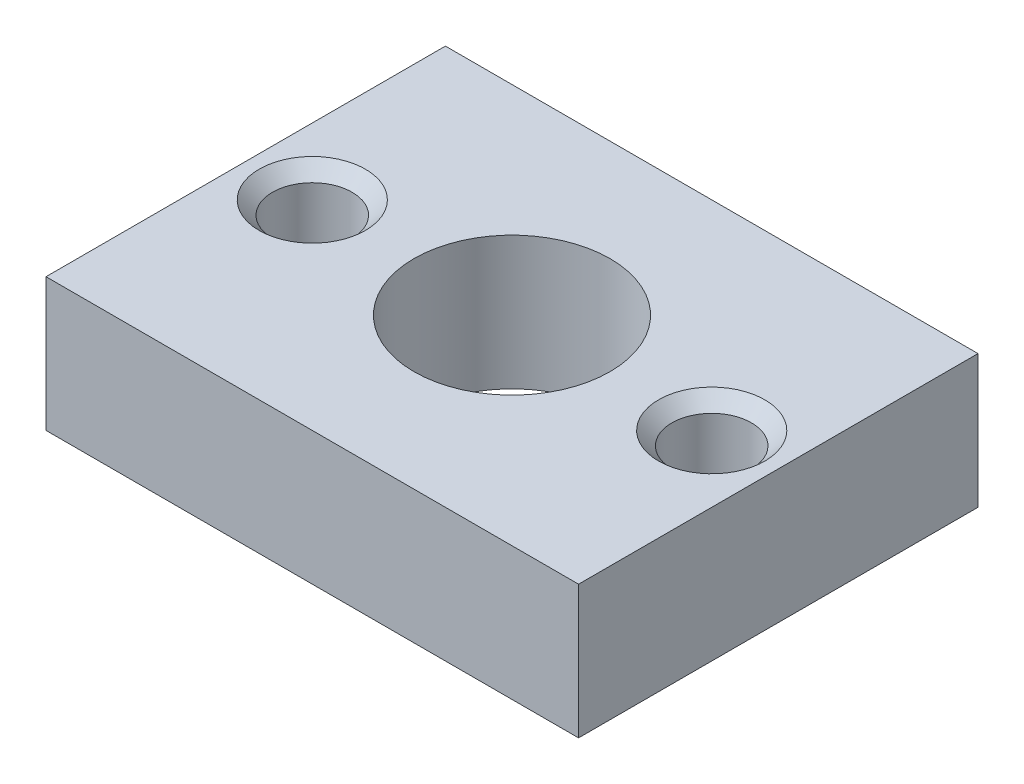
ISO-10303-21;
HEADER;
FILE_DESCRIPTION(('STEP AP214'),'2;1');
FILE_NAME('part.step','',(''),(''),'','','');
FILE_SCHEMA(('AUTOMOTIVE_DESIGN { 1 0 10303 214 1 1 1 1 }'));
ENDSEC;
DATA;
#1=APPLICATION_CONTEXT('core data for automotive mechanical design processes');
#2=APPLICATION_PROTOCOL_DEFINITION('international standard','automotive_design',2000,#1);
#3=PRODUCT_CONTEXT('',#1,'mechanical');
#4=PRODUCT('Part','Part','',(#3));
#5=PRODUCT_RELATED_PRODUCT_CATEGORY('part','',(#4));
#6=PRODUCT_DEFINITION_FORMATION('','',#4);
#7=PRODUCT_DEFINITION_CONTEXT('part definition',#1,'design');
#8=PRODUCT_DEFINITION('design','',#6,#7);
#9=PRODUCT_DEFINITION_SHAPE('','',#8);
#10=(LENGTH_UNIT() NAMED_UNIT(*) SI_UNIT(.MILLI.,.METRE.));
#11=(NAMED_UNIT(*) PLANE_ANGLE_UNIT() SI_UNIT($,.RADIAN.));
#12=(NAMED_UNIT(*) SI_UNIT($,.STERADIAN.) SOLID_ANGLE_UNIT());
#13=UNCERTAINTY_MEASURE_WITH_UNIT(LENGTH_MEASURE(1.E-05),#10,'distance_accuracy_value','');
#14=(GEOMETRIC_REPRESENTATION_CONTEXT(3) GLOBAL_UNCERTAINTY_ASSIGNED_CONTEXT((#13)) GLOBAL_UNIT_ASSIGNED_CONTEXT((#10,
#11,#12)) REPRESENTATION_CONTEXT('',''));
#15=CARTESIAN_POINT('',(0.,0.,0.));
#16=DIRECTION('',(0.,0.,1.));
#17=DIRECTION('',(1.,0.,0.));
#18=AXIS2_PLACEMENT_3D('',#15,#16,#17);
#19=CARTESIAN_POINT('',(12.7,0.,-9.525));
#20=DIRECTION('',(0.,-1.,0.));
#21=DIRECTION('',(0.,0.,-1.));
#22=AXIS2_PLACEMENT_3D('',#19,#20,#21);
#23=PLANE('',#22);
#24=CARTESIAN_POINT('',(0.,0.,0.));
#25=DIRECTION('',(0.,1.,0.));
#26=DIRECTION('',(0.,0.,1.));
#27=AXIS2_PLACEMENT_3D('',#24,#25,#26);
#28=CIRCLE('',#27,4.6736);
#29=CARTESIAN_POINT('',(0.,0.,4.6736));
#30=VERTEX_POINT('',#29);
#31=EDGE_CURVE('E127',#30,#30,#28,.T.);
#32=ORIENTED_EDGE('',*,*,#31,.T.);
#33=EDGE_LOOP('',(#32));
#34=FACE_BOUND('',#33,.T.);
#35=DIRECTION('',(0.,0.,-1.));
#36=VECTOR('',#35,1.);
#37=CARTESIAN_POINT('',(12.7,0.,9.525));
#38=LINE('',#37,#36);
#39=CARTESIAN_POINT('',(12.7,0.,9.525));
#40=VERTEX_POINT('',#39);
#41=CARTESIAN_POINT('',(12.7,0.,-9.525));
#42=VERTEX_POINT('',#41);
#43=EDGE_CURVE('E96',#40,#42,#38,.T.);
#44=ORIENTED_EDGE('',*,*,#43,.F.);
#45=DIRECTION('',(1.,0.,0.));
#46=VECTOR('',#45,1.);
#47=CARTESIAN_POINT('',(-12.7,0.,9.525));
#48=LINE('',#47,#46);
#49=CARTESIAN_POINT('',(-12.7,0.,9.525));
#50=VERTEX_POINT('',#49);
#51=EDGE_CURVE('E72',#50,#40,#48,.T.);
#52=ORIENTED_EDGE('',*,*,#51,.F.);
#53=DIRECTION('',(0.,0.,1.));
#54=VECTOR('',#53,1.);
#55=CARTESIAN_POINT('',(-12.7,0.,9.525));
#56=LINE('',#55,#54);
#57=CARTESIAN_POINT('',(-12.7,0.,-9.525));
#58=VERTEX_POINT('',#57);
#59=EDGE_CURVE('E66',#58,#50,#56,.T.);
#60=ORIENTED_EDGE('',*,*,#59,.F.);
#61=DIRECTION('',(-1.,0.,0.));
#62=VECTOR('',#61,1.);
#63=CARTESIAN_POINT('',(-12.7,0.,-9.525));
#64=LINE('',#63,#62);
#65=EDGE_CURVE('E88',#42,#58,#64,.T.);
#66=ORIENTED_EDGE('',*,*,#65,.F.);
#67=EDGE_LOOP('',(#44,#52,#60,#66));
#68=FACE_BOUND('',#67,.T.);
#69=CARTESIAN_POINT('',(9.525,0.,0.));
#70=DIRECTION('',(0.,1.,0.));
#71=DIRECTION('',(0.,0.,1.));
#72=AXIS2_PLACEMENT_3D('',#69,#70,#71);
#73=CIRCLE('',#72,1.89864999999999);
#74=CARTESIAN_POINT('',(9.525,0.,1.89864999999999));
#75=VERTEX_POINT('',#74);
#76=EDGE_CURVE('E99',#75,#75,#73,.T.);
#77=ORIENTED_EDGE('',*,*,#76,.T.);
#78=EDGE_LOOP('',(#77));
#79=FACE_BOUND('',#78,.T.);
#80=CARTESIAN_POINT('',(-9.525,0.,0.));
#81=DIRECTION('',(0.,1.,0.));
#82=DIRECTION('',(0.,0.,1.));
#83=AXIS2_PLACEMENT_3D('',#80,#81,#82);
#84=CIRCLE('',#83,1.89864999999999);
#85=CARTESIAN_POINT('',(-9.525,0.,1.89864999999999));
#86=VERTEX_POINT('',#85);
#87=EDGE_CURVE('E118',#86,#86,#84,.T.);
#88=ORIENTED_EDGE('',*,*,#87,.T.);
#89=EDGE_LOOP('',(#88));
#90=FACE_BOUND('',#89,.T.);
#91=ADVANCED_FACE('F32',(#34,#68,#79,#90),#23,.T.);
#92=CARTESIAN_POINT('',(12.7,6.35,9.525));
#93=DIRECTION('',(-1.,0.,0.));
#94=DIRECTION('',(0.,0.,1.));
#95=AXIS2_PLACEMENT_3D('',#92,#93,#94);
#96=PLANE('',#95);
#97=ORIENTED_EDGE('',*,*,#43,.T.);
#98=DIRECTION('',(0.,-1.,0.));
#99=VECTOR('',#98,1.);
#100=CARTESIAN_POINT('',(12.7,6.35,-9.525));
#101=LINE('',#100,#99);
#102=CARTESIAN_POINT('',(12.7,6.35,-9.525));
#103=VERTEX_POINT('',#102);
#104=EDGE_CURVE('E11',#103,#42,#101,.T.);
#105=ORIENTED_EDGE('',*,*,#104,.F.);
#106=DIRECTION('',(0.,0.,-1.));
#107=VECTOR('',#106,1.);
#108=CARTESIAN_POINT('',(12.7,6.35,9.525));
#109=LINE('',#108,#107);
#110=CARTESIAN_POINT('',(12.7,6.35,9.525));
#111=VERTEX_POINT('',#110);
#112=EDGE_CURVE('E84',#111,#103,#109,.T.);
#113=ORIENTED_EDGE('',*,*,#112,.F.);
#114=DIRECTION('',(0.,-1.,0.));
#115=VECTOR('',#114,1.);
#116=CARTESIAN_POINT('',(12.7,6.35,9.525));
#117=LINE('',#116,#115);
#118=EDGE_CURVE('E92',#111,#40,#117,.T.);
#119=ORIENTED_EDGE('',*,*,#118,.T.);
#120=EDGE_LOOP('',(#97,#105,#113,#119));
#121=FACE_BOUND('',#120,.T.);
#122=ADVANCED_FACE('F34',(#121),#96,.F.);
#123=CARTESIAN_POINT('',(-12.7,6.35,-9.525));
#124=DIRECTION('',(0.,0.,1.));
#125=DIRECTION('',(1.,0.,0.));
#126=AXIS2_PLACEMENT_3D('',#123,#124,#125);
#127=PLANE('',#126);
#128=ORIENTED_EDGE('',*,*,#65,.T.);
#129=DIRECTION('',(0.,-1.,0.));
#130=VECTOR('',#129,1.);
#131=CARTESIAN_POINT('',(-12.7,6.35,-9.525));
#132=LINE('',#131,#130);
#133=CARTESIAN_POINT('',(-12.7,6.35,-9.525));
#134=VERTEX_POINT('',#133);
#135=EDGE_CURVE('E41',#134,#58,#132,.T.);
#136=ORIENTED_EDGE('',*,*,#135,.F.);
#137=DIRECTION('',(-1.,0.,0.));
#138=VECTOR('',#137,1.);
#139=CARTESIAN_POINT('',(-12.7,6.35,-9.525));
#140=LINE('',#139,#138);
#141=EDGE_CURVE('E79',#103,#134,#140,.T.);
#142=ORIENTED_EDGE('',*,*,#141,.F.);
#143=ORIENTED_EDGE('',*,*,#104,.T.);
#144=EDGE_LOOP('',(#128,#136,#142,#143));
#145=FACE_BOUND('',#144,.T.);
#146=ADVANCED_FACE('F87',(#145),#127,.F.);
#147=CARTESIAN_POINT('',(-12.7,6.35,9.525));
#148=DIRECTION('',(1.,0.,0.));
#149=DIRECTION('',(0.,0.,-1.));
#150=AXIS2_PLACEMENT_3D('',#147,#148,#149);
#151=PLANE('',#150);
#152=ORIENTED_EDGE('',*,*,#59,.T.);
#153=DIRECTION('',(0.,-1.,0.));
#154=VECTOR('',#153,1.);
#155=CARTESIAN_POINT('',(-12.7,6.35,9.525));
#156=LINE('',#155,#154);
#157=CARTESIAN_POINT('',(-12.7,6.35,9.525));
#158=VERTEX_POINT('',#157);
#159=EDGE_CURVE('E89',#158,#50,#156,.T.);
#160=ORIENTED_EDGE('',*,*,#159,.F.);
#161=DIRECTION('',(0.,0.,1.));
#162=VECTOR('',#161,1.);
#163=CARTESIAN_POINT('',(-12.7,6.35,9.525));
#164=LINE('',#163,#162);
#165=EDGE_CURVE('E82',#134,#158,#164,.T.);
#166=ORIENTED_EDGE('',*,*,#165,.F.);
#167=ORIENTED_EDGE('',*,*,#135,.T.);
#168=EDGE_LOOP('',(#152,#160,#166,#167));
#169=FACE_BOUND('',#168,.T.);
#170=ADVANCED_FACE('F90',(#169),#151,.F.);
#171=CARTESIAN_POINT('',(-12.7,6.35,9.525));
#172=DIRECTION('',(0.,0.,-1.));
#173=DIRECTION('',(-1.,0.,0.));
#174=AXIS2_PLACEMENT_3D('',#171,#172,#173);
#175=PLANE('',#174);
#176=ORIENTED_EDGE('',*,*,#51,.T.);
#177=ORIENTED_EDGE('',*,*,#118,.F.);
#178=DIRECTION('',(1.,0.,0.));
#179=VECTOR('',#178,1.);
#180=CARTESIAN_POINT('',(-12.7,6.35,9.525));
#181=LINE('',#180,#179);
#182=EDGE_CURVE('E49',#158,#111,#181,.T.);
#183=ORIENTED_EDGE('',*,*,#182,.F.);
#184=ORIENTED_EDGE('',*,*,#159,.T.);
#185=EDGE_LOOP('',(#176,#177,#183,#184));
#186=FACE_BOUND('',#185,.T.);
#187=ADVANCED_FACE('F104',(#186),#175,.F.);
#188=CARTESIAN_POINT('',(12.7,6.35,-9.525));
#189=DIRECTION('',(0.,-1.,0.));
#190=DIRECTION('',(0.,0.,-1.));
#191=AXIS2_PLACEMENT_3D('',#188,#189,#190);
#192=PLANE('',#191);
#193=CARTESIAN_POINT('',(0.,6.35,0.));
#194=DIRECTION('',(0.,1.,0.));
#195=DIRECTION('',(0.,0.,1.));
#196=AXIS2_PLACEMENT_3D('',#193,#194,#195);
#197=CIRCLE('',#196,4.67359999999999);
#198=CARTESIAN_POINT('',(0.,6.35,4.67359999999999));
#199=VERTEX_POINT('',#198);
#200=EDGE_CURVE('E130',#199,#199,#197,.T.);
#201=ORIENTED_EDGE('',*,*,#200,.F.);
#202=EDGE_LOOP('',(#201));
#203=FACE_BOUND('',#202,.T.);
#204=CARTESIAN_POINT('',(-9.525,6.35,0.));
#205=DIRECTION('',(0.,1.,0.));
#206=DIRECTION('',(0.,0.,1.));
#207=AXIS2_PLACEMENT_3D('',#204,#205,#206);
#208=CIRCLE('',#207,2.53365);
#209=CARTESIAN_POINT('',(-9.525,6.35,2.53365));
#210=VERTEX_POINT('',#209);
#211=EDGE_CURVE('E124',#210,#210,#208,.T.);
#212=ORIENTED_EDGE('',*,*,#211,.F.);
#213=EDGE_LOOP('',(#212));
#214=FACE_BOUND('',#213,.T.);
#215=CARTESIAN_POINT('',(9.525,6.35,0.));
#216=DIRECTION('',(0.,1.,0.));
#217=DIRECTION('',(0.,0.,1.));
#218=AXIS2_PLACEMENT_3D('',#215,#216,#217);
#219=CIRCLE('',#218,2.53365);
#220=CARTESIAN_POINT('',(9.525,6.35,2.53365));
#221=VERTEX_POINT('',#220);
#222=EDGE_CURVE('E115',#221,#221,#219,.T.);
#223=ORIENTED_EDGE('',*,*,#222,.F.);
#224=EDGE_LOOP('',(#223));
#225=FACE_BOUND('',#224,.T.);
#226=ORIENTED_EDGE('',*,*,#112,.T.);
#227=ORIENTED_EDGE('',*,*,#141,.T.);
#228=ORIENTED_EDGE('',*,*,#165,.T.);
#229=ORIENTED_EDGE('',*,*,#182,.T.);
#230=EDGE_LOOP('',(#226,#227,#228,#229));
#231=FACE_BOUND('',#230,.T.);
#232=ADVANCED_FACE('F80',(#203,#214,#225,#231),#192,.F.);
#233=CARTESIAN_POINT('',(9.525,6.35,0.));
#234=DIRECTION('',(0.,1.,0.));
#235=DIRECTION('',(0.,0.,1.));
#236=AXIS2_PLACEMENT_3D('',#233,#234,#235);
#237=CYLINDRICAL_SURFACE('',#236,1.89864999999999);
#238=ORIENTED_EDGE('',*,*,#76,.F.);
#239=EDGE_LOOP('',(#238));
#240=FACE_BOUND('',#239,.T.);
#241=CARTESIAN_POINT('',(9.525,5.715,0.));
#242=DIRECTION('',(0.,1.,0.));
#243=DIRECTION('',(0.,0.,1.));
#244=AXIS2_PLACEMENT_3D('',#241,#242,#243);
#245=CIRCLE('',#244,1.89865);
#246=CARTESIAN_POINT('',(9.525,5.715,1.89865));
#247=VERTEX_POINT('',#246);
#248=EDGE_CURVE('E112',#247,#247,#245,.T.);
#249=ORIENTED_EDGE('',*,*,#248,.T.);
#250=EDGE_LOOP('',(#249));
#251=FACE_BOUND('',#250,.T.);
#252=ADVANCED_FACE('F138',(#240,#251),#237,.F.);
#253=CARTESIAN_POINT('',(9.525,6.35,0.));
#254=DIRECTION('',(0.,1.,0.));
#255=DIRECTION('',(0.,0.,1.));
#256=AXIS2_PLACEMENT_3D('',#253,#254,#255);
#257=CONICAL_SURFACE('',#256,2.53365,0.785398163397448);
#258=ORIENTED_EDGE('',*,*,#248,.F.);
#259=EDGE_LOOP('',(#258));
#260=FACE_BOUND('',#259,.T.);
#261=ORIENTED_EDGE('',*,*,#222,.T.);
#262=EDGE_LOOP('',(#261));
#263=FACE_BOUND('',#262,.T.);
#264=ADVANCED_FACE('F144',(#260,#263),#257,.F.);
#265=CARTESIAN_POINT('',(-9.525,6.35,0.));
#266=DIRECTION('',(0.,1.,0.));
#267=DIRECTION('',(0.,0.,1.));
#268=AXIS2_PLACEMENT_3D('',#265,#266,#267);
#269=CYLINDRICAL_SURFACE('',#268,1.89864999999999);
#270=ORIENTED_EDGE('',*,*,#87,.F.);
#271=EDGE_LOOP('',(#270));
#272=FACE_BOUND('',#271,.T.);
#273=CARTESIAN_POINT('',(-9.525,5.715,0.));
#274=DIRECTION('',(0.,1.,0.));
#275=DIRECTION('',(0.,0.,1.));
#276=AXIS2_PLACEMENT_3D('',#273,#274,#275);
#277=CIRCLE('',#276,1.89865);
#278=CARTESIAN_POINT('',(-9.525,5.715,1.89865));
#279=VERTEX_POINT('',#278);
#280=EDGE_CURVE('E121',#279,#279,#277,.T.);
#281=ORIENTED_EDGE('',*,*,#280,.T.);
#282=EDGE_LOOP('',(#281));
#283=FACE_BOUND('',#282,.T.);
#284=ADVANCED_FACE('F146',(#272,#283),#269,.F.);
#285=CARTESIAN_POINT('',(-9.525,6.35,0.));
#286=DIRECTION('',(0.,1.,0.));
#287=DIRECTION('',(0.,0.,1.));
#288=AXIS2_PLACEMENT_3D('',#285,#286,#287);
#289=CONICAL_SURFACE('',#288,2.53365,0.785398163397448);
#290=ORIENTED_EDGE('',*,*,#280,.F.);
#291=EDGE_LOOP('',(#290));
#292=FACE_BOUND('',#291,.T.);
#293=ORIENTED_EDGE('',*,*,#211,.T.);
#294=EDGE_LOOP('',(#293));
#295=FACE_BOUND('',#294,.T.);
#296=ADVANCED_FACE('F153',(#292,#295),#289,.F.);
#297=CARTESIAN_POINT('',(0.,6.35,0.));
#298=DIRECTION('',(0.,1.,0.));
#299=DIRECTION('',(0.,0.,1.));
#300=AXIS2_PLACEMENT_3D('',#297,#298,#299);
#301=CYLINDRICAL_SURFACE('',#300,4.67359999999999);
#302=ORIENTED_EDGE('',*,*,#31,.F.);
#303=EDGE_LOOP('',(#302));
#304=FACE_BOUND('',#303,.T.);
#305=ORIENTED_EDGE('',*,*,#200,.T.);
#306=EDGE_LOOP('',(#305));
#307=FACE_BOUND('',#306,.T.);
#308=ADVANCED_FACE('F134',(#304,#307),#301,.F.);
#309=CLOSED_SHELL('',(#91,#122,#146,#170,#187,#232,#252,#264,#284,#296,#308));
#310=MANIFOLD_SOLID_BREP('B2',#309);
#311=ADVANCED_BREP_SHAPE_REPRESENTATION('',(#18,#310),#14);
#312=SHAPE_DEFINITION_REPRESENTATION(#9,#311);
ENDSEC;
END-ISO-10303-21;
